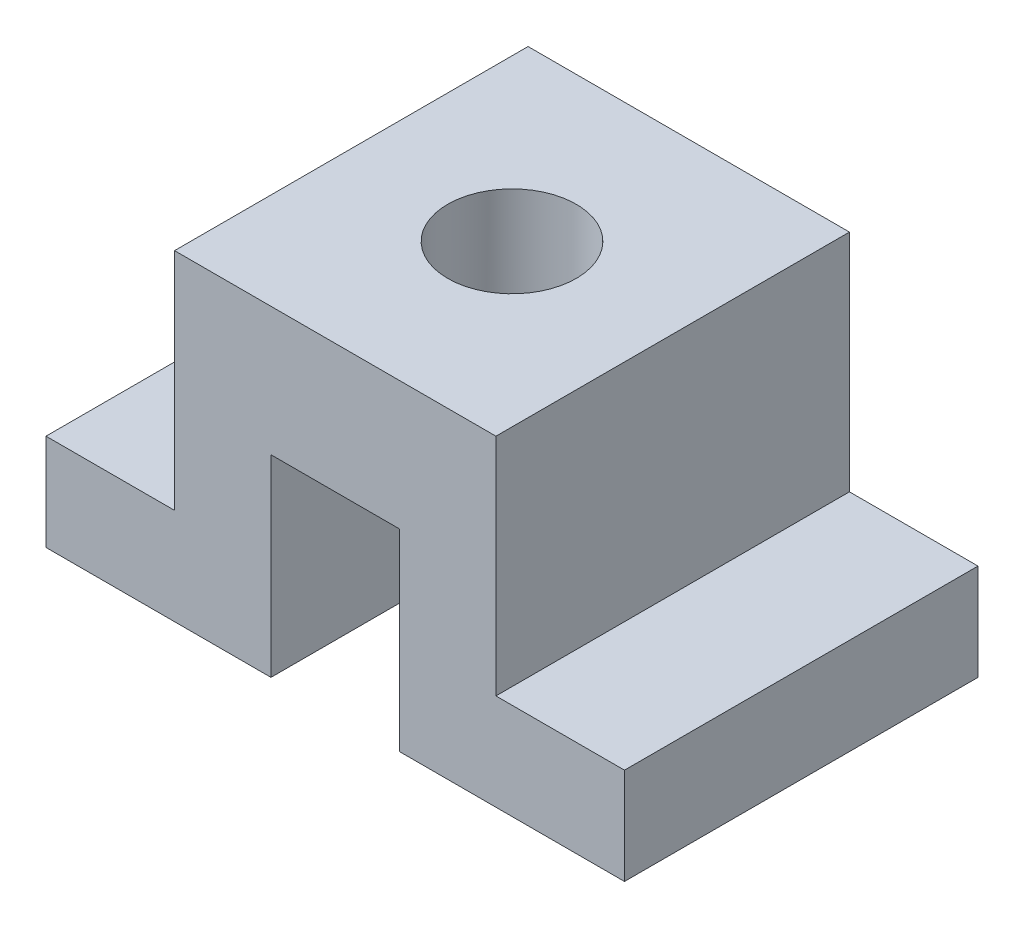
ISO-10303-21;
HEADER;
FILE_DESCRIPTION(('STEP AP214'),'2;1');
FILE_NAME('part.step','',(''),(''),'','','');
FILE_SCHEMA(('AUTOMOTIVE_DESIGN { 1 0 10303 214 1 1 1 1 }'));
ENDSEC;
DATA;
#1=APPLICATION_CONTEXT('core data for automotive mechanical design processes');
#2=APPLICATION_PROTOCOL_DEFINITION('international standard','automotive_design',2000,#1);
#3=PRODUCT_CONTEXT('',#1,'mechanical');
#4=PRODUCT('Part','Part','',(#3));
#5=PRODUCT_RELATED_PRODUCT_CATEGORY('part','',(#4));
#6=PRODUCT_DEFINITION_FORMATION('','',#4);
#7=PRODUCT_DEFINITION_CONTEXT('part definition',#1,'design');
#8=PRODUCT_DEFINITION('design','',#6,#7);
#9=PRODUCT_DEFINITION_SHAPE('','',#8);
#10=(LENGTH_UNIT() NAMED_UNIT(*) SI_UNIT(.MILLI.,.METRE.));
#11=(NAMED_UNIT(*) PLANE_ANGLE_UNIT() SI_UNIT($,.RADIAN.));
#12=(NAMED_UNIT(*) SI_UNIT($,.STERADIAN.) SOLID_ANGLE_UNIT());
#13=UNCERTAINTY_MEASURE_WITH_UNIT(LENGTH_MEASURE(1.E-05),#10,'distance_accuracy_value','');
#14=(GEOMETRIC_REPRESENTATION_CONTEXT(3) GLOBAL_UNCERTAINTY_ASSIGNED_CONTEXT((#13)) GLOBAL_UNIT_ASSIGNED_CONTEXT((#10,
#11,#12)) REPRESENTATION_CONTEXT('',''));
#15=CARTESIAN_POINT('',(0.,0.,0.));
#16=DIRECTION('',(0.,0.,1.));
#17=DIRECTION('',(1.,0.,0.));
#18=AXIS2_PLACEMENT_3D('',#15,#16,#17);
#19=CARTESIAN_POINT('',(35.,30.,-55.));
#20=DIRECTION('',(0.,1.,0.));
#21=DIRECTION('',(0.,0.,1.));
#22=AXIS2_PLACEMENT_3D('',#19,#20,#21);
#23=PLANE('',#22);
#24=DIRECTION('',(0.,0.,1.));
#25=VECTOR('',#24,1.);
#26=CARTESIAN_POINT('',(55.,30.,-55.));
#27=LINE('',#26,#25);
#28=CARTESIAN_POINT('',(55.,30.,-55.));
#29=VERTEX_POINT('',#28);
#30=CARTESIAN_POINT('',(55.,30.,-27.5));
#31=VERTEX_POINT('',#30);
#32=EDGE_CURVE('E135',#29,#31,#27,.T.);
#33=ORIENTED_EDGE('',*,*,#32,.T.);
#34=CARTESIAN_POINT('',(45.,30.,-27.5));
#35=DIRECTION('',(0.,1.,0.));
#36=DIRECTION('',(0.,0.,1.));
#37=AXIS2_PLACEMENT_3D('',#34,#35,#36);
#38=CIRCLE('',#37,10.);
#39=CARTESIAN_POINT('',(35.,30.,-27.5));
#40=VERTEX_POINT('',#39);
#41=EDGE_CURVE('E45',#31,#40,#38,.T.);
#42=ORIENTED_EDGE('',*,*,#41,.T.);
#43=DIRECTION('',(0.,0.,1.));
#44=VECTOR('',#43,1.);
#45=CARTESIAN_POINT('',(35.,30.,-55.));
#46=LINE('',#45,#44);
#47=CARTESIAN_POINT('',(35.,30.,-55.));
#48=VERTEX_POINT('',#47);
#49=EDGE_CURVE('E133',#48,#40,#46,.T.);
#50=ORIENTED_EDGE('',*,*,#49,.F.);
#51=DIRECTION('',(-1.,0.,0.));
#52=VECTOR('',#51,1.);
#53=CARTESIAN_POINT('',(35.,30.,-55.));
#54=LINE('',#53,#52);
#55=EDGE_CURVE('E163',#29,#48,#54,.T.);
#56=ORIENTED_EDGE('',*,*,#55,.F.);
#57=EDGE_LOOP('',(#33,#42,#50,#56));
#58=FACE_BOUND('',#57,.T.);
#59=ADVANCED_FACE('F31',(#58),#23,.F.);
#60=CARTESIAN_POINT('',(0.,0.,-55.));
#61=DIRECTION('',(0.,-1.,0.));
#62=DIRECTION('',(0.,0.,-1.));
#63=AXIS2_PLACEMENT_3D('',#60,#61,#62);
#64=PLANE('',#63);
#65=DIRECTION('',(0.,0.,1.));
#66=VECTOR('',#65,1.);
#67=CARTESIAN_POINT('',(35.,0.,-55.));
#68=LINE('',#67,#66);
#69=CARTESIAN_POINT('',(35.,0.,-55.));
#70=VERTEX_POINT('',#69);
#71=CARTESIAN_POINT('',(35.,0.,0.));
#72=VERTEX_POINT('',#71);
#73=EDGE_CURVE('E161',#70,#72,#68,.T.);
#74=ORIENTED_EDGE('',*,*,#73,.T.);
#75=DIRECTION('',(1.,0.,0.));
#76=VECTOR('',#75,1.);
#77=CARTESIAN_POINT('',(0.,0.,0.));
#78=LINE('',#77,#76);
#79=CARTESIAN_POINT('',(0.,0.,0.));
#80=VERTEX_POINT('',#79);
#81=EDGE_CURVE('E207',#80,#72,#78,.T.);
#82=ORIENTED_EDGE('',*,*,#81,.F.);
#83=DIRECTION('',(0.,0.,1.));
#84=VECTOR('',#83,1.);
#85=CARTESIAN_POINT('',(0.,0.,0.));
#86=LINE('',#85,#84);
#87=CARTESIAN_POINT('',(0.,0.,-55.));
#88=VERTEX_POINT('',#87);
#89=EDGE_CURVE('E193',#88,#80,#86,.T.);
#90=ORIENTED_EDGE('',*,*,#89,.F.);
#91=DIRECTION('',(-1.,0.,0.));
#92=VECTOR('',#91,1.);
#93=CARTESIAN_POINT('',(0.,0.,-55.));
#94=LINE('',#93,#92);
#95=EDGE_CURVE('E213',#70,#88,#94,.T.);
#96=ORIENTED_EDGE('',*,*,#95,.F.);
#97=EDGE_LOOP('',(#74,#82,#90,#96));
#98=FACE_BOUND('',#97,.T.);
#99=ADVANCED_FACE('F259',(#98),#64,.T.);
#100=CARTESIAN_POINT('',(0.,50.,0.));
#101=DIRECTION('',(1.,0.,0.));
#102=DIRECTION('',(0.,0.,-1.));
#103=AXIS2_PLACEMENT_3D('',#100,#101,#102);
#104=PLANE('',#103);
#105=DIRECTION('',(0.,-1.,0.));
#106=VECTOR('',#105,1.);
#107=CARTESIAN_POINT('',(0.,50.,0.));
#108=LINE('',#107,#106);
#109=CARTESIAN_POINT('',(0.,15.,0.));
#110=VERTEX_POINT('',#109);
#111=EDGE_CURVE('E11',#110,#80,#108,.T.);
#112=ORIENTED_EDGE('',*,*,#111,.F.);
#113=DIRECTION('',(0.,0.,1.));
#114=VECTOR('',#113,1.);
#115=CARTESIAN_POINT('',(0.,15.,-55.));
#116=LINE('',#115,#114);
#117=CARTESIAN_POINT('',(0.,15.,-55.));
#118=VERTEX_POINT('',#117);
#119=EDGE_CURVE('E186',#118,#110,#116,.T.);
#120=ORIENTED_EDGE('',*,*,#119,.F.);
#121=DIRECTION('',(0.,-1.,0.));
#122=VECTOR('',#121,1.);
#123=CARTESIAN_POINT('',(0.,50.,-55.));
#124=LINE('',#123,#122);
#125=EDGE_CURVE('E203',#118,#88,#124,.T.);
#126=ORIENTED_EDGE('',*,*,#125,.T.);
#127=ORIENTED_EDGE('',*,*,#89,.T.);
#128=EDGE_LOOP('',(#112,#120,#126,#127));
#129=FACE_BOUND('',#128,.T.);
#130=ADVANCED_FACE('F33',(#129),#104,.F.);
#131=CARTESIAN_POINT('',(0.,50.,0.));
#132=DIRECTION('',(0.,0.,-1.));
#133=DIRECTION('',(-1.,0.,0.));
#134=AXIS2_PLACEMENT_3D('',#131,#132,#133);
#135=PLANE('',#134);
#136=ORIENTED_EDGE('',*,*,#81,.T.);
#137=DIRECTION('',(0.,-1.,0.));
#138=VECTOR('',#137,1.);
#139=CARTESIAN_POINT('',(35.,0.,0.));
#140=LINE('',#139,#138);
#141=CARTESIAN_POINT('',(35.,30.,0.));
#142=VERTEX_POINT('',#141);
#143=EDGE_CURVE('E136',#142,#72,#140,.T.);
#144=ORIENTED_EDGE('',*,*,#143,.F.);
#145=DIRECTION('',(-1.,0.,0.));
#146=VECTOR('',#145,1.);
#147=CARTESIAN_POINT('',(35.,30.,0.));
#148=LINE('',#147,#146);
#149=CARTESIAN_POINT('',(55.,30.,0.));
#150=VERTEX_POINT('',#149);
#151=EDGE_CURVE('E141',#150,#142,#148,.T.);
#152=ORIENTED_EDGE('',*,*,#151,.F.);
#153=DIRECTION('',(0.,1.,0.));
#154=VECTOR('',#153,1.);
#155=CARTESIAN_POINT('',(55.,0.,0.));
#156=LINE('',#155,#154);
#157=CARTESIAN_POINT('',(55.,0.,0.));
#158=VERTEX_POINT('',#157);
#159=EDGE_CURVE('E261',#158,#150,#156,.T.);
#160=ORIENTED_EDGE('',*,*,#159,.F.);
#161=CARTESIAN_POINT('',(90.,0.,0.));
#162=VERTEX_POINT('',#161);
#163=EDGE_CURVE('E206',#158,#162,#78,.T.);
#164=ORIENTED_EDGE('',*,*,#163,.T.);
#165=DIRECTION('',(0.,-1.,0.));
#166=VECTOR('',#165,1.);
#167=CARTESIAN_POINT('',(90.,50.,0.));
#168=LINE('',#167,#166);
#169=CARTESIAN_POINT('',(90.,15.,0.));
#170=VERTEX_POINT('',#169);
#171=EDGE_CURVE('E39',#170,#162,#168,.T.);
#172=ORIENTED_EDGE('',*,*,#171,.F.);
#173=DIRECTION('',(1.,0.,0.));
#174=VECTOR('',#173,1.);
#175=CARTESIAN_POINT('',(90.,15.,0.));
#176=LINE('',#175,#174);
#177=CARTESIAN_POINT('',(70.,15.,0.));
#178=VERTEX_POINT('',#177);
#179=EDGE_CURVE('E152',#178,#170,#176,.T.);
#180=ORIENTED_EDGE('',*,*,#179,.F.);
#181=DIRECTION('',(0.,-1.,0.));
#182=VECTOR('',#181,1.);
#183=CARTESIAN_POINT('',(70.,50.,0.));
#184=LINE('',#183,#182);
#185=CARTESIAN_POINT('',(70.,50.,0.));
#186=VERTEX_POINT('',#185);
#187=EDGE_CURVE('E150',#186,#178,#184,.T.);
#188=ORIENTED_EDGE('',*,*,#187,.F.);
#189=DIRECTION('',(1.,0.,0.));
#190=VECTOR('',#189,1.);
#191=CARTESIAN_POINT('',(0.,50.,0.));
#192=LINE('',#191,#190);
#193=CARTESIAN_POINT('',(20.,50.,0.));
#194=VERTEX_POINT('',#193);
#195=EDGE_CURVE('E197',#194,#186,#192,.T.);
#196=ORIENTED_EDGE('',*,*,#195,.F.);
#197=DIRECTION('',(0.,1.,0.));
#198=VECTOR('',#197,1.);
#199=CARTESIAN_POINT('',(20.,50.,0.));
#200=LINE('',#199,#198);
#201=CARTESIAN_POINT('',(20.,15.,0.));
#202=VERTEX_POINT('',#201);
#203=EDGE_CURVE('E183',#202,#194,#200,.T.);
#204=ORIENTED_EDGE('',*,*,#203,.F.);
#205=DIRECTION('',(1.,0.,0.));
#206=VECTOR('',#205,1.);
#207=CARTESIAN_POINT('',(0.,15.,0.));
#208=LINE('',#207,#206);
#209=EDGE_CURVE('E175',#110,#202,#208,.T.);
#210=ORIENTED_EDGE('',*,*,#209,.F.);
#211=ORIENTED_EDGE('',*,*,#111,.T.);
#212=EDGE_LOOP('',(#136,#144,#152,#160,#164,#172,#180,#188,#196,#204,#210,#211));
#213=FACE_BOUND('',#212,.T.);
#214=ADVANCED_FACE('F238',(#213),#135,.F.);
#215=CARTESIAN_POINT('',(90.,50.,0.));
#216=DIRECTION('',(-1.,0.,0.));
#217=DIRECTION('',(0.,0.,1.));
#218=AXIS2_PLACEMENT_3D('',#215,#216,#217);
#219=PLANE('',#218);
#220=DIRECTION('',(0.,-1.,0.));
#221=VECTOR('',#220,1.);
#222=CARTESIAN_POINT('',(90.,50.,-55.));
#223=LINE('',#222,#221);
#224=CARTESIAN_POINT('',(90.,15.,-55.));
#225=VERTEX_POINT('',#224);
#226=CARTESIAN_POINT('',(90.,0.,-55.));
#227=VERTEX_POINT('',#226);
#228=EDGE_CURVE('E218',#225,#227,#223,.T.);
#229=ORIENTED_EDGE('',*,*,#228,.F.);
#230=DIRECTION('',(0.,0.,1.));
#231=VECTOR('',#230,1.);
#232=CARTESIAN_POINT('',(90.,15.,-55.));
#233=LINE('',#232,#231);
#234=EDGE_CURVE('E172',#225,#170,#233,.T.);
#235=ORIENTED_EDGE('',*,*,#234,.T.);
#236=ORIENTED_EDGE('',*,*,#171,.T.);
#237=DIRECTION('',(0.,0.,-1.));
#238=VECTOR('',#237,1.);
#239=CARTESIAN_POINT('',(90.,0.,0.));
#240=LINE('',#239,#238);
#241=EDGE_CURVE('E210',#162,#227,#240,.T.);
#242=ORIENTED_EDGE('',*,*,#241,.T.);
#243=EDGE_LOOP('',(#229,#235,#236,#242));
#244=FACE_BOUND('',#243,.T.);
#245=ADVANCED_FACE('F224',(#244),#219,.F.);
#246=CARTESIAN_POINT('',(0.,50.,-55.));
#247=DIRECTION('',(0.,0.,1.));
#248=DIRECTION('',(1.,0.,0.));
#249=AXIS2_PLACEMENT_3D('',#246,#247,#248);
#250=PLANE('',#249);
#251=ORIENTED_EDGE('',*,*,#55,.T.);
#252=DIRECTION('',(0.,-1.,0.));
#253=VECTOR('',#252,1.);
#254=CARTESIAN_POINT('',(35.,0.,-55.));
#255=LINE('',#254,#253);
#256=EDGE_CURVE('E148',#48,#70,#255,.T.);
#257=ORIENTED_EDGE('',*,*,#256,.T.);
#258=ORIENTED_EDGE('',*,*,#95,.T.);
#259=ORIENTED_EDGE('',*,*,#125,.F.);
#260=DIRECTION('',(1.,0.,0.));
#261=VECTOR('',#260,1.);
#262=CARTESIAN_POINT('',(0.,15.,-55.));
#263=LINE('',#262,#261);
#264=CARTESIAN_POINT('',(20.,15.,-55.));
#265=VERTEX_POINT('',#264);
#266=EDGE_CURVE('E179',#118,#265,#263,.T.);
#267=ORIENTED_EDGE('',*,*,#266,.T.);
#268=DIRECTION('',(0.,1.,0.));
#269=VECTOR('',#268,1.);
#270=CARTESIAN_POINT('',(20.,50.,-55.));
#271=LINE('',#270,#269);
#272=CARTESIAN_POINT('',(20.,50.,-55.));
#273=VERTEX_POINT('',#272);
#274=EDGE_CURVE('E182',#265,#273,#271,.T.);
#275=ORIENTED_EDGE('',*,*,#274,.T.);
#276=DIRECTION('',(-1.,0.,0.));
#277=VECTOR('',#276,1.);
#278=CARTESIAN_POINT('',(0.,50.,-55.));
#279=LINE('',#278,#277);
#280=CARTESIAN_POINT('',(70.,50.,-55.));
#281=VERTEX_POINT('',#280);
#282=EDGE_CURVE('E200',#281,#273,#279,.T.);
#283=ORIENTED_EDGE('',*,*,#282,.F.);
#284=DIRECTION('',(0.,-1.,0.));
#285=VECTOR('',#284,1.);
#286=CARTESIAN_POINT('',(70.,50.,-55.));
#287=LINE('',#286,#285);
#288=CARTESIAN_POINT('',(70.,15.,-55.));
#289=VERTEX_POINT('',#288);
#290=EDGE_CURVE('E164',#281,#289,#287,.T.);
#291=ORIENTED_EDGE('',*,*,#290,.T.);
#292=DIRECTION('',(1.,0.,0.));
#293=VECTOR('',#292,1.);
#294=CARTESIAN_POINT('',(90.,15.,-55.));
#295=LINE('',#294,#293);
#296=EDGE_CURVE('E167',#289,#225,#295,.T.);
#297=ORIENTED_EDGE('',*,*,#296,.T.);
#298=ORIENTED_EDGE('',*,*,#228,.T.);
#299=CARTESIAN_POINT('',(55.,0.,-55.));
#300=VERTEX_POINT('',#299);
#301=EDGE_CURVE('E201',#227,#300,#94,.T.);
#302=ORIENTED_EDGE('',*,*,#301,.T.);
#303=DIRECTION('',(0.,1.,0.));
#304=VECTOR('',#303,1.);
#305=CARTESIAN_POINT('',(55.,0.,-55.));
#306=LINE('',#305,#304);
#307=EDGE_CURVE('E53',#300,#29,#306,.T.);
#308=ORIENTED_EDGE('',*,*,#307,.T.);
#309=EDGE_LOOP('',(#251,#257,#258,#259,#267,#275,#283,#291,#297,#298,#302,#308));
#310=FACE_BOUND('',#309,.T.);
#311=ADVANCED_FACE('F232',(#310),#250,.F.);
#312=CARTESIAN_POINT('',(0.,50.,-55.));
#313=DIRECTION('',(0.,-1.,0.));
#314=DIRECTION('',(0.,0.,-1.));
#315=AXIS2_PLACEMENT_3D('',#312,#313,#314);
#316=PLANE('',#315);
#317=CARTESIAN_POINT('',(45.,50.,-27.5));
#318=DIRECTION('',(0.,1.,0.));
#319=DIRECTION('',(0.,0.,1.));
#320=AXIS2_PLACEMENT_3D('',#317,#318,#319);
#321=CIRCLE('',#320,10.);
#322=CARTESIAN_POINT('',(45.,50.,-17.5));
#323=VERTEX_POINT('',#322);
#324=EDGE_CURVE('E127',#323,#323,#321,.T.);
#325=ORIENTED_EDGE('',*,*,#324,.F.);
#326=EDGE_LOOP('',(#325));
#327=FACE_BOUND('',#326,.T.);
#328=ORIENTED_EDGE('',*,*,#195,.T.);
#329=DIRECTION('',(0.,0.,1.));
#330=VECTOR('',#329,1.);
#331=CARTESIAN_POINT('',(70.,50.,-55.));
#332=LINE('',#331,#330);
#333=EDGE_CURVE('E169',#281,#186,#332,.T.);
#334=ORIENTED_EDGE('',*,*,#333,.F.);
#335=ORIENTED_EDGE('',*,*,#282,.T.);
#336=DIRECTION('',(0.,0.,1.));
#337=VECTOR('',#336,1.);
#338=CARTESIAN_POINT('',(20.,50.,-55.));
#339=LINE('',#338,#337);
#340=EDGE_CURVE('E190',#273,#194,#339,.T.);
#341=ORIENTED_EDGE('',*,*,#340,.T.);
#342=EDGE_LOOP('',(#328,#334,#335,#341));
#343=FACE_BOUND('',#342,.T.);
#344=ADVANCED_FACE('F244',(#327,#343),#316,.F.);
#345=DIRECTION('',(0.,0.,1.));
#346=VECTOR('',#345,1.);
#347=CARTESIAN_POINT('',(55.,0.,-55.));
#348=LINE('',#347,#346);
#349=EDGE_CURVE('E159',#300,#158,#348,.T.);
#350=ORIENTED_EDGE('',*,*,#349,.F.);
#351=ORIENTED_EDGE('',*,*,#301,.F.);
#352=ORIENTED_EDGE('',*,*,#241,.F.);
#353=ORIENTED_EDGE('',*,*,#163,.F.);
#354=EDGE_LOOP('',(#350,#351,#352,#353));
#355=FACE_BOUND('',#354,.T.);
#356=ADVANCED_FACE('F230',(#355),#64,.T.);
#357=CARTESIAN_POINT('',(20.,50.,-55.));
#358=DIRECTION('',(1.,0.,0.));
#359=DIRECTION('',(0.,1.,0.));
#360=AXIS2_PLACEMENT_3D('',#357,#358,#359);
#361=PLANE('',#360);
#362=ORIENTED_EDGE('',*,*,#203,.T.);
#363=ORIENTED_EDGE('',*,*,#340,.F.);
#364=ORIENTED_EDGE('',*,*,#274,.F.);
#365=DIRECTION('',(0.,0.,1.));
#366=VECTOR('',#365,1.);
#367=CARTESIAN_POINT('',(20.,15.,-55.));
#368=LINE('',#367,#366);
#369=EDGE_CURVE('E194',#265,#202,#368,.T.);
#370=ORIENTED_EDGE('',*,*,#369,.T.);
#371=EDGE_LOOP('',(#362,#363,#364,#370));
#372=FACE_BOUND('',#371,.T.);
#373=ADVANCED_FACE('F248',(#372),#361,.F.);
#374=CARTESIAN_POINT('',(0.,15.,-55.));
#375=DIRECTION('',(0.,-1.,0.));
#376=DIRECTION('',(0.,0.,-1.));
#377=AXIS2_PLACEMENT_3D('',#374,#375,#376);
#378=PLANE('',#377);
#379=ORIENTED_EDGE('',*,*,#209,.T.);
#380=ORIENTED_EDGE('',*,*,#369,.F.);
#381=ORIENTED_EDGE('',*,*,#266,.F.);
#382=ORIENTED_EDGE('',*,*,#119,.T.);
#383=EDGE_LOOP('',(#379,#380,#381,#382));
#384=FACE_BOUND('',#383,.T.);
#385=ADVANCED_FACE('F252',(#384),#378,.F.);
#386=CARTESIAN_POINT('',(90.,15.,-55.));
#387=DIRECTION('',(0.,-1.,0.));
#388=DIRECTION('',(1.,0.,0.));
#389=AXIS2_PLACEMENT_3D('',#386,#387,#388);
#390=PLANE('',#389);
#391=ORIENTED_EDGE('',*,*,#179,.T.);
#392=ORIENTED_EDGE('',*,*,#234,.F.);
#393=ORIENTED_EDGE('',*,*,#296,.F.);
#394=DIRECTION('',(0.,0.,1.));
#395=VECTOR('',#394,1.);
#396=CARTESIAN_POINT('',(70.,15.,-55.));
#397=LINE('',#396,#395);
#398=EDGE_CURVE('E176',#289,#178,#397,.T.);
#399=ORIENTED_EDGE('',*,*,#398,.T.);
#400=EDGE_LOOP('',(#391,#392,#393,#399));
#401=FACE_BOUND('',#400,.T.);
#402=ADVANCED_FACE('F236',(#401),#390,.F.);
#403=CARTESIAN_POINT('',(70.,50.,-55.));
#404=DIRECTION('',(-1.,0.,0.));
#405=DIRECTION('',(0.,0.,1.));
#406=AXIS2_PLACEMENT_3D('',#403,#404,#405);
#407=PLANE('',#406);
#408=ORIENTED_EDGE('',*,*,#187,.T.);
#409=ORIENTED_EDGE('',*,*,#398,.F.);
#410=ORIENTED_EDGE('',*,*,#290,.F.);
#411=ORIENTED_EDGE('',*,*,#333,.T.);
#412=EDGE_LOOP('',(#408,#409,#410,#411));
#413=FACE_BOUND('',#412,.T.);
#414=ADVANCED_FACE('F294',(#413),#407,.F.);
#415=CARTESIAN_POINT('',(35.,0.,-55.));
#416=DIRECTION('',(-1.,0.,0.));
#417=DIRECTION('',(0.,0.,1.));
#418=AXIS2_PLACEMENT_3D('',#415,#416,#417);
#419=PLANE('',#418);
#420=ORIENTED_EDGE('',*,*,#143,.T.);
#421=ORIENTED_EDGE('',*,*,#73,.F.);
#422=ORIENTED_EDGE('',*,*,#256,.F.);
#423=ORIENTED_EDGE('',*,*,#49,.T.);
#424=EDGE_CURVE('E138',#40,#142,#46,.T.);
#425=ORIENTED_EDGE('',*,*,#424,.T.);
#426=EDGE_LOOP('',(#420,#421,#422,#423,#425));
#427=FACE_BOUND('',#426,.T.);
#428=ADVANCED_FACE('F146',(#427),#419,.F.);
#429=ORIENTED_EDGE('',*,*,#424,.F.);
#430=EDGE_CURVE('E122',#40,#31,#38,.T.);
#431=ORIENTED_EDGE('',*,*,#430,.T.);
#432=EDGE_CURVE('E158',#31,#150,#27,.T.);
#433=ORIENTED_EDGE('',*,*,#432,.T.);
#434=ORIENTED_EDGE('',*,*,#151,.T.);
#435=EDGE_LOOP('',(#429,#431,#433,#434));
#436=FACE_BOUND('',#435,.T.);
#437=ADVANCED_FACE('F139',(#436),#23,.F.);
#438=CARTESIAN_POINT('',(55.,0.,-55.));
#439=DIRECTION('',(1.,0.,0.));
#440=DIRECTION('',(0.,1.,0.));
#441=AXIS2_PLACEMENT_3D('',#438,#439,#440);
#442=PLANE('',#441);
#443=ORIENTED_EDGE('',*,*,#349,.T.);
#444=ORIENTED_EDGE('',*,*,#159,.T.);
#445=ORIENTED_EDGE('',*,*,#432,.F.);
#446=ORIENTED_EDGE('',*,*,#32,.F.);
#447=ORIENTED_EDGE('',*,*,#307,.F.);
#448=EDGE_LOOP('',(#443,#444,#445,#446,#447));
#449=FACE_BOUND('',#448,.T.);
#450=ADVANCED_FACE('F289',(#449),#442,.F.);
#451=CARTESIAN_POINT('',(45.,0.,-27.5));
#452=DIRECTION('',(0.,1.,0.));
#453=DIRECTION('',(0.,0.,1.));
#454=AXIS2_PLACEMENT_3D('',#451,#452,#453);
#455=CYLINDRICAL_SURFACE('',#454,10.);
#456=ORIENTED_EDGE('',*,*,#324,.T.);
#457=EDGE_LOOP('',(#456));
#458=FACE_BOUND('',#457,.T.);
#459=ORIENTED_EDGE('',*,*,#430,.F.);
#460=ORIENTED_EDGE('',*,*,#41,.F.);
#461=EDGE_LOOP('',(#459,#460));
#462=FACE_BOUND('',#461,.T.);
#463=ADVANCED_FACE('F123',(#458,#462),#455,.F.);
#464=CLOSED_SHELL('',(#59,#99,#130,#214,#245,#311,#344,#356,#373,#385,#402,#414,#428,#437,#450,#463));
#465=MANIFOLD_SOLID_BREP('B2',#464);
#466=ADVANCED_BREP_SHAPE_REPRESENTATION('',(#18,#465),#14);
#467=SHAPE_DEFINITION_REPRESENTATION(#9,#466);
ENDSEC;
END-ISO-10303-21;
